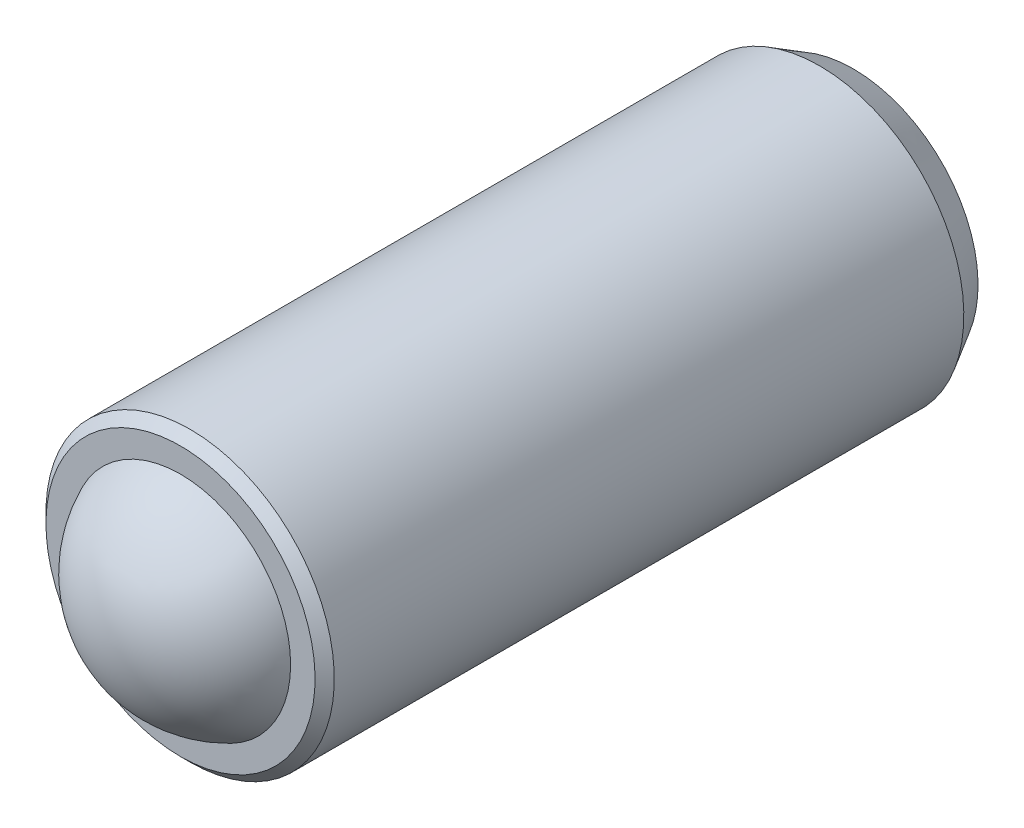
ISO-10303-21;
HEADER;
FILE_DESCRIPTION(('STEP AP214'),'2;1');
FILE_NAME('part.step','',(''),(''),'','','');
FILE_SCHEMA(('AUTOMOTIVE_DESIGN { 1 0 10303 214 1 1 1 1 }'));
ENDSEC;
DATA;
#1=APPLICATION_CONTEXT('core data for automotive mechanical design processes');
#2=APPLICATION_PROTOCOL_DEFINITION('international standard','automotive_design',2000,#1);
#3=PRODUCT_CONTEXT('',#1,'mechanical');
#4=PRODUCT('Part','Part','',(#3));
#5=PRODUCT_RELATED_PRODUCT_CATEGORY('part','',(#4));
#6=PRODUCT_DEFINITION_FORMATION('','',#4);
#7=PRODUCT_DEFINITION_CONTEXT('part definition',#1,'design');
#8=PRODUCT_DEFINITION('design','',#6,#7);
#9=PRODUCT_DEFINITION_SHAPE('','',#8);
#10=(LENGTH_UNIT() NAMED_UNIT(*) SI_UNIT(.MILLI.,.METRE.));
#11=(NAMED_UNIT(*) PLANE_ANGLE_UNIT() SI_UNIT($,.RADIAN.));
#12=(NAMED_UNIT(*) SI_UNIT($,.STERADIAN.) SOLID_ANGLE_UNIT());
#13=UNCERTAINTY_MEASURE_WITH_UNIT(LENGTH_MEASURE(1.E-05),#10,'distance_accuracy_value','');
#14=(GEOMETRIC_REPRESENTATION_CONTEXT(3) GLOBAL_UNCERTAINTY_ASSIGNED_CONTEXT((#13)) GLOBAL_UNIT_ASSIGNED_CONTEXT((#10,
#11,#12)) REPRESENTATION_CONTEXT('',''));
#15=CARTESIAN_POINT('',(0.,0.,0.));
#16=DIRECTION('',(0.,0.,1.));
#17=DIRECTION('',(1.,0.,0.));
#18=AXIS2_PLACEMENT_3D('',#15,#16,#17);
#19=CARTESIAN_POINT('',(0.,0.,0.));
#20=DIRECTION('',(0.,0.,-1.));
#21=DIRECTION('',(0.,1.,0.));
#22=AXIS2_PLACEMENT_3D('',#19,#20,#21);
#23=PLANE('',#22);
#24=CARTESIAN_POINT('',(0.,0.,0.));
#25=DIRECTION('',(0.,0.,-1.));
#26=DIRECTION('',(0.,1.,0.));
#27=AXIS2_PLACEMENT_3D('',#24,#25,#26);
#28=CIRCLE('',#27,2.59585481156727);
#29=CARTESIAN_POINT('',(0.,2.59585481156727,0.));
#30=VERTEX_POINT('',#29);
#31=EDGE_CURVE('E27',#30,#30,#28,.T.);
#32=ORIENTED_EDGE('',*,*,#31,.T.);
#33=EDGE_LOOP('',(#32));
#34=FACE_BOUND('',#33,.T.);
#35=ADVANCED_FACE('F12',(#34),#23,.T.);
#36=CARTESIAN_POINT('',(0.,0.,-5.56770138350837));
#37=DIRECTION('',(0.,0.,-1.));
#38=DIRECTION('',(0.,1.,0.));
#39=AXIS2_PLACEMENT_3D('',#36,#37,#38);
#40=CYLINDRICAL_SURFACE('',#39,3.);
#41=CARTESIAN_POINT('',(0.,0.,13.8));
#42=DIRECTION('',(0.,0.,1.));
#43=DIRECTION('',(0.,-1.,0.));
#44=AXIS2_PLACEMENT_3D('',#41,#42,#43);
#45=CIRCLE('',#44,3.);
#46=CARTESIAN_POINT('',(0.,-3.00000000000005,13.8));
#47=VERTEX_POINT('',#46);
#48=EDGE_CURVE('E19',#47,#47,#45,.F.);
#49=ORIENTED_EDGE('',*,*,#48,.T.);
#50=EDGE_LOOP('',(#49));
#51=FACE_BOUND('',#50,.T.);
#52=CARTESIAN_POINT('',(0.,0.,0.7));
#53=DIRECTION('',(0.,0.,-1.));
#54=DIRECTION('',(0.,1.,0.));
#55=AXIS2_PLACEMENT_3D('',#52,#53,#54);
#56=CIRCLE('',#55,3.);
#57=CARTESIAN_POINT('',(0.,3.,0.700000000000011));
#58=VERTEX_POINT('',#57);
#59=EDGE_CURVE('E23',#58,#58,#56,.F.);
#60=ORIENTED_EDGE('',*,*,#59,.T.);
#61=EDGE_LOOP('',(#60));
#62=FACE_BOUND('',#61,.T.);
#63=ADVANCED_FACE('F49',(#51,#62),#40,.T.);
#64=CARTESIAN_POINT('',(3.,0.,14.));
#65=DIRECTION('',(0.,0.,1.));
#66=DIRECTION('',(0.,-1.,0.));
#67=AXIS2_PLACEMENT_3D('',#64,#65,#66);
#68=PLANE('',#67);
#69=CARTESIAN_POINT('',(0.,0.,14.));
#70=DIRECTION('',(0.,0.,1.));
#71=DIRECTION('',(0.,-1.,0.));
#72=AXIS2_PLACEMENT_3D('',#69,#70,#71);
#73=CIRCLE('',#72,2.8);
#74=CARTESIAN_POINT('',(0.,-2.80000000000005,14.));
#75=VERTEX_POINT('',#74);
#76=EDGE_CURVE('E8',#75,#75,#73,.T.);
#77=ORIENTED_EDGE('',*,*,#76,.T.);
#78=EDGE_LOOP('',(#77));
#79=FACE_BOUND('',#78,.T.);
#80=CARTESIAN_POINT('',(0.,0.,14.));
#81=DIRECTION('',(0.,0.,-1.));
#82=DIRECTION('',(0.,1.,0.));
#83=AXIS2_PLACEMENT_3D('',#80,#81,#82);
#84=CIRCLE('',#83,2.29128784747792);
#85=CARTESIAN_POINT('',(0.,2.29128784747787,14.));
#86=VERTEX_POINT('',#85);
#87=EDGE_CURVE('E32',#86,#86,#84,.T.);
#88=ORIENTED_EDGE('',*,*,#87,.T.);
#89=EDGE_LOOP('',(#88));
#90=FACE_BOUND('',#89,.T.);
#91=ADVANCED_FACE('F36',(#79,#90),#68,.T.);
#92=CARTESIAN_POINT('',(0.,0.,13.));
#93=DIRECTION('',(0.,0.,-1.));
#94=DIRECTION('',(1.,0.,0.));
#95=AXIS2_PLACEMENT_3D('',#92,#93,#94);
#96=SPHERICAL_SURFACE('',#95,2.5);
#97=ORIENTED_EDGE('',*,*,#87,.F.);
#98=EDGE_LOOP('',(#97));
#99=FACE_BOUND('',#98,.T.);
#100=ADVANCED_FACE('F38',(#99),#96,.T.);
#101=CARTESIAN_POINT('',(0.,0.,0.));
#102=DIRECTION('',(0.,0.,1.));
#103=DIRECTION('',(0.,-1.,0.));
#104=AXIS2_PLACEMENT_3D('',#101,#102,#103);
#105=CONICAL_SURFACE('',#104,2.59585481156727,0.523598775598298);
#106=ORIENTED_EDGE('',*,*,#59,.F.);
#107=EDGE_LOOP('',(#106));
#108=FACE_BOUND('',#107,.T.);
#109=ORIENTED_EDGE('',*,*,#31,.F.);
#110=EDGE_LOOP('',(#109));
#111=FACE_BOUND('',#110,.T.);
#112=ADVANCED_FACE('F40',(#108,#111),#105,.T.);
#113=CARTESIAN_POINT('',(0.,0.,13.8));
#114=DIRECTION('',(0.,0.,-1.));
#115=DIRECTION('',(0.,1.,0.));
#116=AXIS2_PLACEMENT_3D('',#113,#114,#115);
#117=CONICAL_SURFACE('',#116,3.,0.785398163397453);
#118=ORIENTED_EDGE('',*,*,#76,.F.);
#119=EDGE_LOOP('',(#118));
#120=FACE_BOUND('',#119,.T.);
#121=ORIENTED_EDGE('',*,*,#48,.F.);
#122=EDGE_LOOP('',(#121));
#123=FACE_BOUND('',#122,.T.);
#124=ADVANCED_FACE('F14',(#120,#123),#117,.T.);
#125=CLOSED_SHELL('',(#35,#63,#91,#100,#112,#124));
#126=MANIFOLD_SOLID_BREP('B1',#125);
#127=ADVANCED_BREP_SHAPE_REPRESENTATION('',(#18,#126),#14);
#128=SHAPE_DEFINITION_REPRESENTATION(#9,#127);
ENDSEC;
END-ISO-10303-21;
